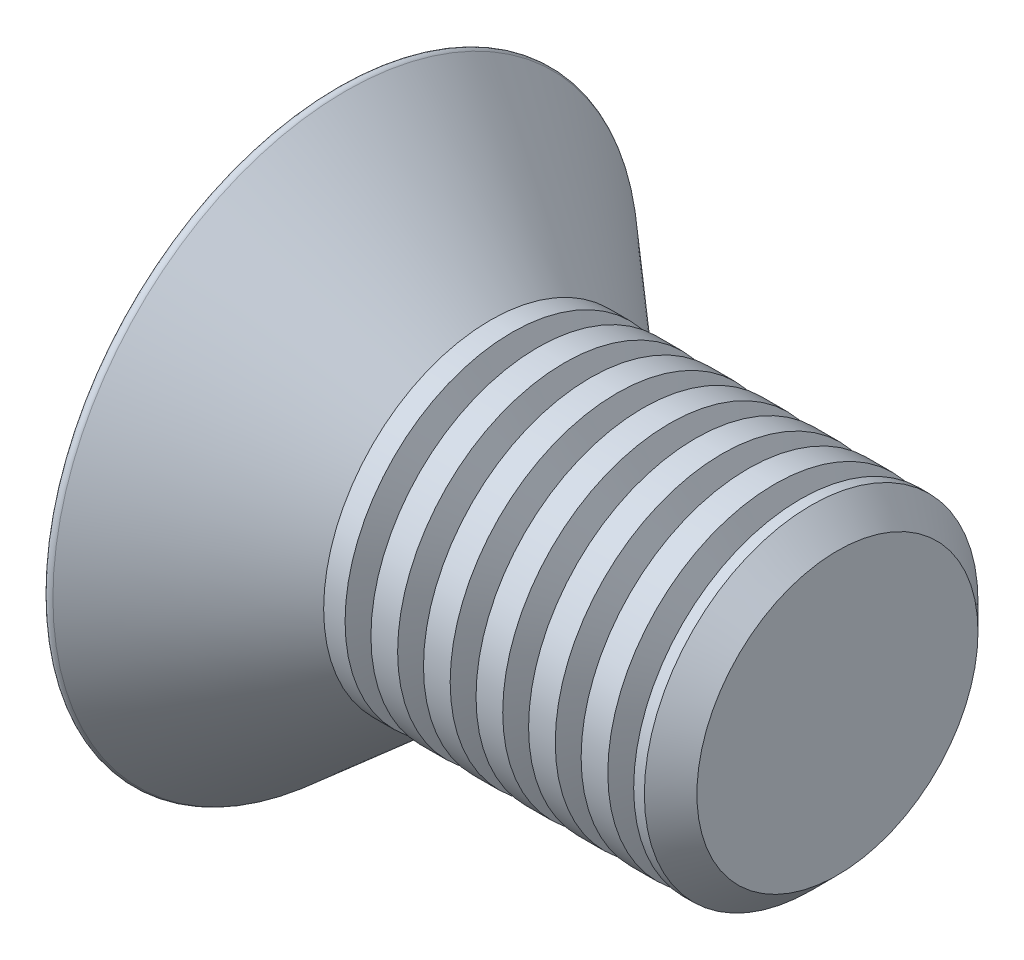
from build123d import *

# Parameters (mm, degrees)
FILLET1_R           = 0.05
CUT_EXTRUDE1_DEPTH  = 0.5
FILLET2_R           = 0.5
SKETCH3_R           = 1.5875
BOSS_EXTRUDE1_DEPTH = 3.175
CHAMFER1_SIZE       = 0.25


with BuildPart() as part:
    # Sketch1 → Revolve1 (revolve)
    with BuildSketch(Plane.XY, mode=Mode.PRIVATE) as revolve1_sk:
        Polygon((0, 0), (0, -1.5875), (-0.126532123, -1.5875), (-1.5875, -2.8575), (-1.5875, 0), align=None)
    revolve(revolve1_sk.sketch.rotate(Axis((-1.5875, 0, 0), (1, 0, 0)), 270), axis=Axis((-1.5875, 0, 0), (1, 0, 0)))

    # Fillet1
    fillet1_edges = [part.edges().sort_by_distance(p)[0] for p in [
        (-1.5875, 0, -2.8575),
    ]]
    fillet(fillet1_edges, radius=FILLET1_R)

    # Sketch2 → Cut-Extrude1 (cut)
    with BuildSketch(Plane.ZY.offset(1.5875)):
        Polygon((-0.25, 1.85), (-0.25, 0.25), (-1.85, 0.25), (-1.85, -0.25), (-0.25, -0.25), (-0.25, -1.85), (0.25, -1.85), (0.25, -0.25), (1.85, -0.25), (1.85, 0.25), (0.25, 0.25), (0.25, 1.85), align=None)
    extrude(amount=-CUT_EXTRUDE1_DEPTH, mode=Mode.SUBTRACT)

    # Fillet2
    fillet2_edges = [part.edges().sort_by_distance(p)[0] for p in [
        (-1.3375, 0.25, 0.25),
        (-1.3375, -0.25, 0.25),
        (-1.3375, -0.25, -0.25),
        (-1.3375, 0.25, -0.25),
    ]]
    fillet(fillet2_edges, radius=FILLET2_R)

    # Sketch3 → Boss-Extrude1 (add)
    with BuildSketch(Plane(origin=(0, 0, 0), x_dir=(0, 0, -1), z_dir=(1, 0, 0))):
        with Locations(Location((0, 0, 0), (0, 0, 180))):
            Circle(SKETCH3_R)
    extrude(amount=BOSS_EXTRUDE1_DEPTH)

    # Chamfer1
    chamfer1_edges = [part.edges().sort_by_distance(p)[0] for p in [
        (3.175, 0, -1.5875),
    ]]
    chamfer(chamfer1_edges, length=CHAMFER1_SIZE)

    # Sketch5 → Cut-Revolve1 (revolve, cut)
    with BuildSketch(Plane.XY, mode=Mode.PRIVATE) as cut_revolve1_sk:
        Polygon((0.010953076, 1.735701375), (0.200372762, 1.312696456), (0.389792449, 1.735701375), align=None)
        Polygon((0.510953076, 1.735701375), (0.700372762, 1.312696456), (0.889792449, 1.735701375), align=None)
        Polygon((1.010953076, 1.735701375), (1.200372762, 1.312696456), (1.389792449, 1.735701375), align=None)
        Polygon((1.510953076, 1.735701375), (1.700372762, 1.312696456), (1.889792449, 1.735701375), align=None)
        Polygon((2.010953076, 1.735701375), (2.200372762, 1.312696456), (2.389792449, 1.735701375), align=None)
        Polygon((2.510953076, 1.735701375), (2.700372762, 1.312696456), (2.889792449, 1.735701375), align=None)
        Polygon((3.010953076, 1.735701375), (3.200372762, 1.312696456), (3.389792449, 1.735701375), align=None)
        Polygon((3.510953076, 1.735701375), (3.700372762, 1.312696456), (3.889792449, 1.735701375), align=None)
        Polygon((4.010953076, 1.735701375), (4.200372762, 1.312696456), (4.389792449, 1.735701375), align=None)
    revolve(cut_revolve1_sk.sketch.rotate(Axis((0, 0, 0), (1, 0, 0)), 90), axis=Axis((0, 0, 0), (1, 0, 0)), mode=Mode.SUBTRACT)


solid = part.part
